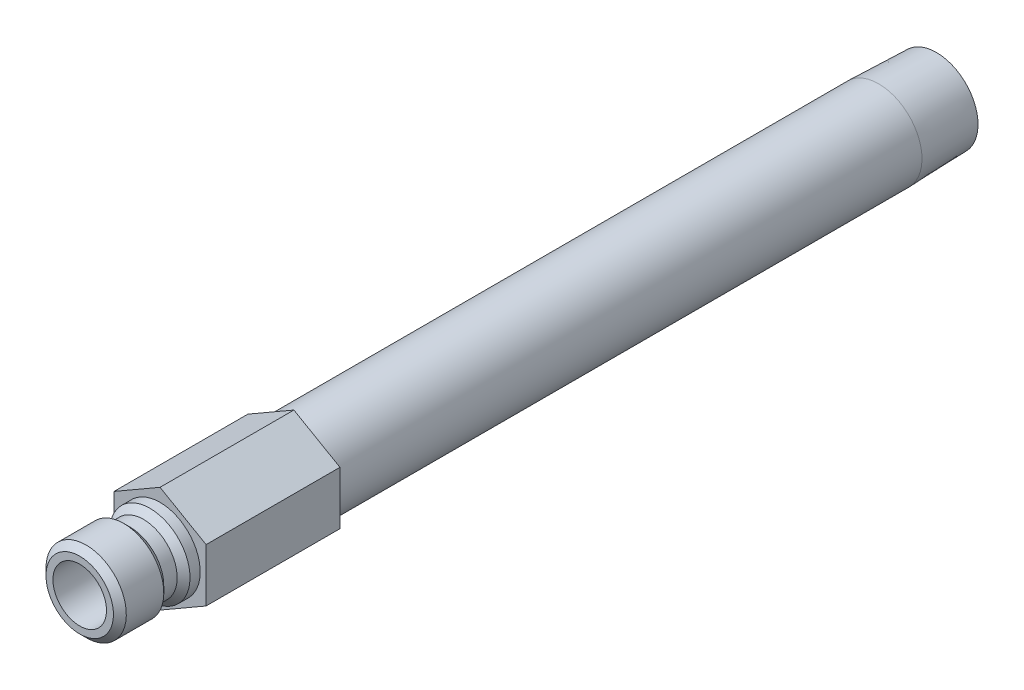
ISO-10303-21;
HEADER;
FILE_DESCRIPTION(('STEP AP214'),'2;1');
FILE_NAME('part.step','',(''),(''),'','','');
FILE_SCHEMA(('AUTOMOTIVE_DESIGN { 1 0 10303 214 1 1 1 1 }'));
ENDSEC;
DATA;
#1=APPLICATION_CONTEXT('core data for automotive mechanical design processes');
#2=APPLICATION_PROTOCOL_DEFINITION('international standard','automotive_design',2000,#1);
#3=PRODUCT_CONTEXT('',#1,'mechanical');
#4=PRODUCT('Part','Part','',(#3));
#5=PRODUCT_RELATED_PRODUCT_CATEGORY('part','',(#4));
#6=PRODUCT_DEFINITION_FORMATION('','',#4);
#7=PRODUCT_DEFINITION_CONTEXT('part definition',#1,'design');
#8=PRODUCT_DEFINITION('design','',#6,#7);
#9=PRODUCT_DEFINITION_SHAPE('','',#8);
#10=(LENGTH_UNIT() NAMED_UNIT(*) SI_UNIT(.MILLI.,.METRE.));
#11=(NAMED_UNIT(*) PLANE_ANGLE_UNIT() SI_UNIT($,.RADIAN.));
#12=(NAMED_UNIT(*) SI_UNIT($,.STERADIAN.) SOLID_ANGLE_UNIT());
#13=UNCERTAINTY_MEASURE_WITH_UNIT(LENGTH_MEASURE(1.E-05),#10,'distance_accuracy_value','');
#14=(GEOMETRIC_REPRESENTATION_CONTEXT(3) GLOBAL_UNCERTAINTY_ASSIGNED_CONTEXT((#13)) GLOBAL_UNIT_ASSIGNED_CONTEXT((#10,
#11,#12)) REPRESENTATION_CONTEXT('',''));
#15=CARTESIAN_POINT('',(0.,0.,0.));
#16=DIRECTION('',(0.,0.,1.));
#17=DIRECTION('',(1.,0.,0.));
#18=AXIS2_PLACEMENT_3D('',#15,#16,#17);
#19=CARTESIAN_POINT('',(0.,4.7625,0.));
#20=DIRECTION('',(0.,0.,1.));
#21=DIRECTION('',(0.,-1.,0.));
#22=AXIS2_PLACEMENT_3D('',#19,#20,#21);
#23=PLANE('',#22);
#24=CARTESIAN_POINT('',(0.,0.,0.));
#25=DIRECTION('',(0.,0.,-1.));
#26=DIRECTION('',(0.,1.,0.));
#27=AXIS2_PLACEMENT_3D('',#24,#25,#26);
#28=CIRCLE('',#27,4.7625);
#29=CARTESIAN_POINT('',(0.,4.7625,0.));
#30=VERTEX_POINT('',#29);
#31=EDGE_CURVE('E166',#30,#30,#28,.T.);
#32=ORIENTED_EDGE('',*,*,#31,.T.);
#33=EDGE_LOOP('',(#32));
#34=FACE_BOUND('',#33,.T.);
#35=DIRECTION('',(-0.866025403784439,-0.5,0.));
#36=VECTOR('',#35,1.);
#37=CARTESIAN_POINT('',(0.,6.3058196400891,0.));
#38=LINE('',#37,#36);
#39=CARTESIAN_POINT('',(0.,6.3058196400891,0.));
#40=VERTEX_POINT('',#39);
#41=CARTESIAN_POINT('',(-5.461,3.15290982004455,0.));
#42=VERTEX_POINT('',#41);
#43=EDGE_CURVE('E122',#40,#42,#38,.T.);
#44=ORIENTED_EDGE('',*,*,#43,.T.);
#45=DIRECTION('',(0.,-1.,0.));
#46=VECTOR('',#45,1.);
#47=CARTESIAN_POINT('',(-5.461,3.15290982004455,0.));
#48=LINE('',#47,#46);
#49=CARTESIAN_POINT('',(-5.461,-3.15290982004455,0.));
#50=VERTEX_POINT('',#49);
#51=EDGE_CURVE('E125',#42,#50,#48,.T.);
#52=ORIENTED_EDGE('',*,*,#51,.T.);
#53=DIRECTION('',(0.866025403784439,-0.5,0.));
#54=VECTOR('',#53,1.);
#55=CARTESIAN_POINT('',(-5.461,-3.15290982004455,0.));
#56=LINE('',#55,#54);
#57=CARTESIAN_POINT('',(0.,-6.30581964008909,0.));
#58=VERTEX_POINT('',#57);
#59=EDGE_CURVE('E129',#50,#58,#56,.T.);
#60=ORIENTED_EDGE('',*,*,#59,.T.);
#61=DIRECTION('',(0.866025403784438,0.5,0.));
#62=VECTOR('',#61,1.);
#63=CARTESIAN_POINT('',(0.,-6.30581964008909,0.));
#64=LINE('',#63,#62);
#65=CARTESIAN_POINT('',(5.461,-3.15290982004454,0.));
#66=VERTEX_POINT('',#65);
#67=EDGE_CURVE('E132',#58,#66,#64,.T.);
#68=ORIENTED_EDGE('',*,*,#67,.T.);
#69=DIRECTION('',(0.,1.,0.));
#70=VECTOR('',#69,1.);
#71=CARTESIAN_POINT('',(5.461,-3.15290982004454,0.));
#72=LINE('',#71,#70);
#73=CARTESIAN_POINT('',(5.461,3.15290982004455,0.));
#74=VERTEX_POINT('',#73);
#75=EDGE_CURVE('E99',#66,#74,#72,.T.);
#76=ORIENTED_EDGE('',*,*,#75,.T.);
#77=DIRECTION('',(-0.866025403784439,0.5,0.));
#78=VECTOR('',#77,1.);
#79=CARTESIAN_POINT('',(5.461,3.15290982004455,0.));
#80=LINE('',#79,#78);
#81=EDGE_CURVE('E135',#74,#40,#80,.T.);
#82=ORIENTED_EDGE('',*,*,#81,.T.);
#83=EDGE_LOOP('',(#44,#52,#60,#68,#76,#82));
#84=FACE_BOUND('',#83,.T.);
#85=ADVANCED_FACE('F33',(#34,#84),#23,.T.);
#86=CARTESIAN_POINT('',(0.,0.,0.));
#87=DIRECTION('',(0.,0.,-1.));
#88=DIRECTION('',(0.,1.,0.));
#89=AXIS2_PLACEMENT_3D('',#86,#87,#88);
#90=CYLINDRICAL_SURFACE('',#89,4.7625);
#91=CARTESIAN_POINT('',(0.,0.,1.2065));
#92=DIRECTION('',(0.,0.,-1.));
#93=DIRECTION('',(0.,1.,0.));
#94=AXIS2_PLACEMENT_3D('',#91,#92,#93);
#95=CIRCLE('',#94,4.7625);
#96=CARTESIAN_POINT('',(0.,4.7625,1.2065));
#97=VERTEX_POINT('',#96);
#98=EDGE_CURVE('E163',#97,#97,#95,.T.);
#99=ORIENTED_EDGE('',*,*,#98,.T.);
#100=EDGE_LOOP('',(#99));
#101=FACE_BOUND('',#100,.T.);
#102=ORIENTED_EDGE('',*,*,#31,.F.);
#103=EDGE_LOOP('',(#102));
#104=FACE_BOUND('',#103,.T.);
#105=ADVANCED_FACE('F192',(#101,#104),#90,.T.);
#106=CARTESIAN_POINT('',(0.,0.,1.2065));
#107=DIRECTION('',(0.,0.,-1.));
#108=DIRECTION('',(0.,1.,0.));
#109=AXIS2_PLACEMENT_3D('',#106,#107,#108);
#110=CONICAL_SURFACE('',#109,4.7625,0.785398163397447);
#111=CARTESIAN_POINT('',(0.,0.,1.9685));
#112=DIRECTION('',(0.,0.,-1.));
#113=DIRECTION('',(0.,1.,0.));
#114=AXIS2_PLACEMENT_3D('',#111,#112,#113);
#115=CIRCLE('',#114,4.0005);
#116=CARTESIAN_POINT('',(0.,4.0005,1.9685));
#117=VERTEX_POINT('',#116);
#118=EDGE_CURVE('E160',#117,#117,#115,.T.);
#119=ORIENTED_EDGE('',*,*,#118,.T.);
#120=EDGE_LOOP('',(#119));
#121=FACE_BOUND('',#120,.T.);
#122=ORIENTED_EDGE('',*,*,#98,.F.);
#123=EDGE_LOOP('',(#122));
#124=FACE_BOUND('',#123,.T.);
#125=ADVANCED_FACE('F198',(#121,#124),#110,.T.);
#126=CARTESIAN_POINT('',(0.,0.,0.));
#127=DIRECTION('',(0.,0.,-1.));
#128=DIRECTION('',(0.,1.,0.));
#129=AXIS2_PLACEMENT_3D('',#126,#127,#128);
#130=CYLINDRICAL_SURFACE('',#129,4.0005);
#131=CARTESIAN_POINT('',(0.,0.,3.556));
#132=DIRECTION('',(0.,0.,-1.));
#133=DIRECTION('',(0.,1.,0.));
#134=AXIS2_PLACEMENT_3D('',#131,#132,#133);
#135=CIRCLE('',#134,4.0005);
#136=CARTESIAN_POINT('',(0.,4.0005,3.556));
#137=VERTEX_POINT('',#136);
#138=EDGE_CURVE('E157',#137,#137,#135,.T.);
#139=ORIENTED_EDGE('',*,*,#138,.T.);
#140=EDGE_LOOP('',(#139));
#141=FACE_BOUND('',#140,.T.);
#142=ORIENTED_EDGE('',*,*,#118,.F.);
#143=EDGE_LOOP('',(#142));
#144=FACE_BOUND('',#143,.T.);
#145=ADVANCED_FACE('F258',(#141,#144),#130,.T.);
#146=CARTESIAN_POINT('',(0.,0.,3.556));
#147=DIRECTION('',(0.,0.,1.));
#148=DIRECTION('',(0.,-1.,0.));
#149=AXIS2_PLACEMENT_3D('',#146,#147,#148);
#150=CONICAL_SURFACE('',#149,4.0005,0.785398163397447);
#151=CARTESIAN_POINT('',(0.,0.,4.318));
#152=DIRECTION('',(0.,0.,-1.));
#153=DIRECTION('',(0.,1.,0.));
#154=AXIS2_PLACEMENT_3D('',#151,#152,#153);
#155=CIRCLE('',#154,4.7625);
#156=CARTESIAN_POINT('',(0.,4.7625,4.318));
#157=VERTEX_POINT('',#156);
#158=EDGE_CURVE('E154',#157,#157,#155,.T.);
#159=ORIENTED_EDGE('',*,*,#158,.T.);
#160=EDGE_LOOP('',(#159));
#161=FACE_BOUND('',#160,.T.);
#162=ORIENTED_EDGE('',*,*,#138,.F.);
#163=EDGE_LOOP('',(#162));
#164=FACE_BOUND('',#163,.T.);
#165=ADVANCED_FACE('F254',(#161,#164),#150,.T.);
#166=CARTESIAN_POINT('',(0.,0.,0.));
#167=DIRECTION('',(0.,0.,-1.));
#168=DIRECTION('',(0.,1.,0.));
#169=AXIS2_PLACEMENT_3D('',#166,#167,#168);
#170=CYLINDRICAL_SURFACE('',#169,4.7625);
#171=CARTESIAN_POINT('',(0.,0.,8.763));
#172=DIRECTION('',(0.,0.,-1.));
#173=DIRECTION('',(0.,1.,0.));
#174=AXIS2_PLACEMENT_3D('',#171,#172,#173);
#175=CIRCLE('',#174,4.7625);
#176=CARTESIAN_POINT('',(0.,4.7625,8.763));
#177=VERTEX_POINT('',#176);
#178=EDGE_CURVE('E151',#177,#177,#175,.T.);
#179=ORIENTED_EDGE('',*,*,#178,.T.);
#180=EDGE_LOOP('',(#179));
#181=FACE_BOUND('',#180,.T.);
#182=ORIENTED_EDGE('',*,*,#158,.F.);
#183=EDGE_LOOP('',(#182));
#184=FACE_BOUND('',#183,.T.);
#185=ADVANCED_FACE('F250',(#181,#184),#170,.T.);
#186=CARTESIAN_POINT('',(0.,0.,8.763));
#187=DIRECTION('',(0.,0.,-1.));
#188=DIRECTION('',(0.,1.,0.));
#189=AXIS2_PLACEMENT_3D('',#186,#187,#188);
#190=CONICAL_SURFACE('',#189,4.7625,0.785398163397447);
#191=CARTESIAN_POINT('',(0.,0.,9.525));
#192=DIRECTION('',(0.,0.,-1.));
#193=DIRECTION('',(0.,1.,0.));
#194=AXIS2_PLACEMENT_3D('',#191,#192,#193);
#195=CIRCLE('',#194,4.0005);
#196=CARTESIAN_POINT('',(0.,4.0005,9.525));
#197=VERTEX_POINT('',#196);
#198=EDGE_CURVE('E148',#197,#197,#195,.T.);
#199=ORIENTED_EDGE('',*,*,#198,.T.);
#200=EDGE_LOOP('',(#199));
#201=FACE_BOUND('',#200,.T.);
#202=ORIENTED_EDGE('',*,*,#178,.F.);
#203=EDGE_LOOP('',(#202));
#204=FACE_BOUND('',#203,.T.);
#205=ADVANCED_FACE('F246',(#201,#204),#190,.T.);
#206=CARTESIAN_POINT('',(0.,3.175,9.525));
#207=DIRECTION('',(0.,0.,1.));
#208=DIRECTION('',(0.,-1.,0.));
#209=AXIS2_PLACEMENT_3D('',#206,#207,#208);
#210=PLANE('',#209);
#211=CARTESIAN_POINT('',(0.,0.,9.525));
#212=DIRECTION('',(0.,0.,-1.));
#213=DIRECTION('',(0.,1.,0.));
#214=AXIS2_PLACEMENT_3D('',#211,#212,#213);
#215=CIRCLE('',#214,3.175);
#216=CARTESIAN_POINT('',(0.,3.175,9.525));
#217=VERTEX_POINT('',#216);
#218=EDGE_CURVE('E145',#217,#217,#215,.T.);
#219=ORIENTED_EDGE('',*,*,#218,.T.);
#220=EDGE_LOOP('',(#219));
#221=FACE_BOUND('',#220,.T.);
#222=ORIENTED_EDGE('',*,*,#198,.F.);
#223=EDGE_LOOP('',(#222));
#224=FACE_BOUND('',#223,.T.);
#225=ADVANCED_FACE('F242',(#221,#224),#210,.T.);
#226=CARTESIAN_POINT('',(0.,0.,0.));
#227=DIRECTION('',(0.,0.,-1.));
#228=DIRECTION('',(0.,1.,0.));
#229=AXIS2_PLACEMENT_3D('',#226,#227,#228);
#230=CYLINDRICAL_SURFACE('',#229,3.175);
#231=CARTESIAN_POINT('',(0.,0.,0.));
#232=DIRECTION('',(0.,0.,1.));
#233=DIRECTION('',(1.,0.,0.));
#234=AXIS2_PLACEMENT_3D('',#231,#232,#233);
#235=CIRCLE('',#234,3.175);
#236=CARTESIAN_POINT('',(3.175,0.,0.));
#237=VERTEX_POINT('',#236);
#238=EDGE_CURVE('E11',#237,#237,#235,.T.);
#239=ORIENTED_EDGE('',*,*,#238,.F.);
#240=EDGE_LOOP('',(#239));
#241=FACE_BOUND('',#240,.T.);
#242=ORIENTED_EDGE('',*,*,#218,.F.);
#243=EDGE_LOOP('',(#242));
#244=FACE_BOUND('',#243,.T.);
#245=ADVANCED_FACE('F226',(#241,#244),#230,.F.);
#246=CARTESIAN_POINT('',(-5.461,3.15290982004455,0.));
#247=DIRECTION('',(0.,0.,1.));
#248=DIRECTION('',(1.,0.,0.));
#249=AXIS2_PLACEMENT_3D('',#246,#247,#248);
#250=PLANE('',#249);
#251=ORIENTED_EDGE('',*,*,#238,.T.);
#252=EDGE_LOOP('',(#251));
#253=FACE_BOUND('',#252,.T.);
#254=CARTESIAN_POINT('',(0.,0.,0.));
#255=DIRECTION('',(0.,0.,1.));
#256=DIRECTION('',(1.,0.,0.));
#257=AXIS2_PLACEMENT_3D('',#254,#255,#256);
#258=CIRCLE('',#257,2.38124999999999);
#259=CARTESIAN_POINT('',(2.38124999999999,0.,0.));
#260=VERTEX_POINT('',#259);
#261=EDGE_CURVE('E126',#260,#260,#258,.T.);
#262=ORIENTED_EDGE('',*,*,#261,.F.);
#263=EDGE_LOOP('',(#262));
#264=FACE_BOUND('',#263,.T.);
#265=ADVANCED_FACE('F222',(#253,#264),#250,.T.);
#266=CARTESIAN_POINT('',(0.,6.3058196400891,-15.875));
#267=DIRECTION('',(-0.5,0.866025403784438,0.));
#268=DIRECTION('',(-0.866025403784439,-0.5,0.));
#269=AXIS2_PLACEMENT_3D('',#266,#267,#268);
#270=PLANE('',#269);
#271=ORIENTED_EDGE('',*,*,#43,.F.);
#272=DIRECTION('',(0.,0.,1.));
#273=VECTOR('',#272,1.);
#274=CARTESIAN_POINT('',(0.,6.3058196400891,-15.875));
#275=LINE('',#274,#273);
#276=CARTESIAN_POINT('',(0.,6.3058196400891,-15.875));
#277=VERTEX_POINT('',#276);
#278=EDGE_CURVE('E51',#277,#40,#275,.T.);
#279=ORIENTED_EDGE('',*,*,#278,.F.);
#280=DIRECTION('',(-0.866025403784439,-0.5,0.));
#281=VECTOR('',#280,1.);
#282=CARTESIAN_POINT('',(0.,6.3058196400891,-15.875));
#283=LINE('',#282,#281);
#284=CARTESIAN_POINT('',(-5.461,3.15290982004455,-15.875));
#285=VERTEX_POINT('',#284);
#286=EDGE_CURVE('E138',#277,#285,#283,.T.);
#287=ORIENTED_EDGE('',*,*,#286,.T.);
#288=DIRECTION('',(0.,0.,1.));
#289=VECTOR('',#288,1.);
#290=CARTESIAN_POINT('',(-5.461,3.15290982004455,-15.875));
#291=LINE('',#290,#289);
#292=EDGE_CURVE('E86',#285,#42,#291,.T.);
#293=ORIENTED_EDGE('',*,*,#292,.T.);
#294=EDGE_LOOP('',(#271,#279,#287,#293));
#295=FACE_BOUND('',#294,.T.);
#296=ADVANCED_FACE('F225',(#295),#270,.T.);
#297=CARTESIAN_POINT('',(5.461,3.15290982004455,-15.875));
#298=DIRECTION('',(0.5,0.866025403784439,0.));
#299=DIRECTION('',(-0.866025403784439,0.5,0.));
#300=AXIS2_PLACEMENT_3D('',#297,#298,#299);
#301=PLANE('',#300);
#302=ORIENTED_EDGE('',*,*,#81,.F.);
#303=DIRECTION('',(0.,0.,1.));
#304=VECTOR('',#303,1.);
#305=CARTESIAN_POINT('',(5.461,3.15290982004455,-15.875));
#306=LINE('',#305,#304);
#307=CARTESIAN_POINT('',(5.461,3.15290982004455,-15.875));
#308=VERTEX_POINT('',#307);
#309=EDGE_CURVE('E74',#308,#74,#306,.T.);
#310=ORIENTED_EDGE('',*,*,#309,.F.);
#311=DIRECTION('',(-0.866025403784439,0.5,0.));
#312=VECTOR('',#311,1.);
#313=CARTESIAN_POINT('',(5.461,3.15290982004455,-15.875));
#314=LINE('',#313,#312);
#315=EDGE_CURVE('E112',#308,#277,#314,.T.);
#316=ORIENTED_EDGE('',*,*,#315,.T.);
#317=ORIENTED_EDGE('',*,*,#278,.T.);
#318=EDGE_LOOP('',(#302,#310,#316,#317));
#319=FACE_BOUND('',#318,.T.);
#320=ADVANCED_FACE('F228',(#319),#301,.T.);
#321=CARTESIAN_POINT('',(5.461,-3.15290982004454,-15.875));
#322=DIRECTION('',(1.,0.,0.));
#323=DIRECTION('',(0.,1.,0.));
#324=AXIS2_PLACEMENT_3D('',#321,#322,#323);
#325=PLANE('',#324);
#326=ORIENTED_EDGE('',*,*,#75,.F.);
#327=DIRECTION('',(0.,0.,1.));
#328=VECTOR('',#327,1.);
#329=CARTESIAN_POINT('',(5.461,-3.15290982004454,-15.875));
#330=LINE('',#329,#328);
#331=CARTESIAN_POINT('',(5.461,-3.15290982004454,-15.875));
#332=VERTEX_POINT('',#331);
#333=EDGE_CURVE('E94',#332,#66,#330,.T.);
#334=ORIENTED_EDGE('',*,*,#333,.F.);
#335=DIRECTION('',(0.,1.,0.));
#336=VECTOR('',#335,1.);
#337=CARTESIAN_POINT('',(5.461,-3.15290982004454,-15.875));
#338=LINE('',#337,#336);
#339=EDGE_CURVE('E97',#332,#308,#338,.T.);
#340=ORIENTED_EDGE('',*,*,#339,.T.);
#341=ORIENTED_EDGE('',*,*,#309,.T.);
#342=EDGE_LOOP('',(#326,#334,#340,#341));
#343=FACE_BOUND('',#342,.T.);
#344=ADVANCED_FACE('F96',(#343),#325,.T.);
#345=CARTESIAN_POINT('',(0.,-6.30581964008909,-15.875));
#346=DIRECTION('',(0.5,-0.866025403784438,0.));
#347=DIRECTION('',(0.866025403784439,0.5,0.));
#348=AXIS2_PLACEMENT_3D('',#345,#346,#347);
#349=PLANE('',#348);
#350=ORIENTED_EDGE('',*,*,#67,.F.);
#351=DIRECTION('',(0.,0.,1.));
#352=VECTOR('',#351,1.);
#353=CARTESIAN_POINT('',(0.,-6.30581964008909,-15.875));
#354=LINE('',#353,#352);
#355=CARTESIAN_POINT('',(0.,-6.30581964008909,-15.875));
#356=VERTEX_POINT('',#355);
#357=EDGE_CURVE('E104',#356,#58,#354,.T.);
#358=ORIENTED_EDGE('',*,*,#357,.F.);
#359=DIRECTION('',(0.866025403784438,0.5,0.));
#360=VECTOR('',#359,1.);
#361=CARTESIAN_POINT('',(0.,-6.30581964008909,-15.875));
#362=LINE('',#361,#360);
#363=EDGE_CURVE('E110',#356,#332,#362,.T.);
#364=ORIENTED_EDGE('',*,*,#363,.T.);
#365=ORIENTED_EDGE('',*,*,#333,.T.);
#366=EDGE_LOOP('',(#350,#358,#364,#365));
#367=FACE_BOUND('',#366,.T.);
#368=ADVANCED_FACE('F114',(#367),#349,.T.);
#369=CARTESIAN_POINT('',(-5.461,-3.15290982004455,-15.875));
#370=DIRECTION('',(-0.5,-0.866025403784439,0.));
#371=DIRECTION('',(0.866025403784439,-0.5,0.));
#372=AXIS2_PLACEMENT_3D('',#369,#370,#371);
#373=PLANE('',#372);
#374=ORIENTED_EDGE('',*,*,#59,.F.);
#375=DIRECTION('',(0.,0.,1.));
#376=VECTOR('',#375,1.);
#377=CARTESIAN_POINT('',(-5.461,-3.15290982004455,-15.875));
#378=LINE('',#377,#376);
#379=CARTESIAN_POINT('',(-5.461,-3.15290982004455,-15.875));
#380=VERTEX_POINT('',#379);
#381=EDGE_CURVE('E142',#380,#50,#378,.T.);
#382=ORIENTED_EDGE('',*,*,#381,.F.);
#383=DIRECTION('',(0.866025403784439,-0.5,0.));
#384=VECTOR('',#383,1.);
#385=CARTESIAN_POINT('',(-5.461,-3.15290982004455,-15.875));
#386=LINE('',#385,#384);
#387=EDGE_CURVE('E115',#380,#356,#386,.T.);
#388=ORIENTED_EDGE('',*,*,#387,.T.);
#389=ORIENTED_EDGE('',*,*,#357,.T.);
#390=EDGE_LOOP('',(#374,#382,#388,#389));
#391=FACE_BOUND('',#390,.T.);
#392=ADVANCED_FACE('F219',(#391),#373,.T.);
#393=CARTESIAN_POINT('',(-5.461,3.15290982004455,-15.875));
#394=DIRECTION('',(-1.,0.,0.));
#395=DIRECTION('',(0.,0.,1.));
#396=AXIS2_PLACEMENT_3D('',#393,#394,#395);
#397=PLANE('',#396);
#398=ORIENTED_EDGE('',*,*,#51,.F.);
#399=ORIENTED_EDGE('',*,*,#292,.F.);
#400=DIRECTION('',(0.,-1.,0.));
#401=VECTOR('',#400,1.);
#402=CARTESIAN_POINT('',(-5.461,3.15290982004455,-15.875));
#403=LINE('',#402,#401);
#404=EDGE_CURVE('E117',#285,#380,#403,.T.);
#405=ORIENTED_EDGE('',*,*,#404,.T.);
#406=ORIENTED_EDGE('',*,*,#381,.T.);
#407=EDGE_LOOP('',(#398,#399,#405,#406));
#408=FACE_BOUND('',#407,.T.);
#409=ADVANCED_FACE('F214',(#408),#397,.T.);
#410=CARTESIAN_POINT('',(-5.461,3.15290982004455,-15.875));
#411=DIRECTION('',(0.,0.,1.));
#412=DIRECTION('',(1.,0.,0.));
#413=AXIS2_PLACEMENT_3D('',#410,#411,#412);
#414=PLANE('',#413);
#415=CARTESIAN_POINT('',(0.,0.,-15.875));
#416=DIRECTION('',(0.,0.,1.));
#417=DIRECTION('',(1.,0.,0.));
#418=AXIS2_PLACEMENT_3D('',#415,#416,#417);
#419=CIRCLE('',#418,5.1435);
#420=CARTESIAN_POINT('',(5.1435,0.,-15.875));
#421=VERTEX_POINT('',#420);
#422=EDGE_CURVE('E37',#421,#421,#419,.F.);
#423=ORIENTED_EDGE('',*,*,#422,.F.);
#424=EDGE_LOOP('',(#423));
#425=FACE_BOUND('',#424,.T.);
#426=ORIENTED_EDGE('',*,*,#286,.F.);
#427=ORIENTED_EDGE('',*,*,#315,.F.);
#428=ORIENTED_EDGE('',*,*,#339,.F.);
#429=ORIENTED_EDGE('',*,*,#363,.F.);
#430=ORIENTED_EDGE('',*,*,#387,.F.);
#431=ORIENTED_EDGE('',*,*,#404,.F.);
#432=EDGE_LOOP('',(#426,#427,#428,#429,#430,#431));
#433=FACE_BOUND('',#432,.T.);
#434=ADVANCED_FACE('F108',(#425,#433),#414,.F.);
#435=CARTESIAN_POINT('',(0.,0.,0.));
#436=DIRECTION('',(0.,0.,-1.));
#437=DIRECTION('',(0.,1.,0.));
#438=AXIS2_PLACEMENT_3D('',#435,#436,#437);
#439=CYLINDRICAL_SURFACE('',#438,2.38124999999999);
#440=CARTESIAN_POINT('',(0.,0.,-92.075));
#441=DIRECTION('',(0.,0.,-1.));
#442=DIRECTION('',(0.,1.,0.));
#443=AXIS2_PLACEMENT_3D('',#440,#441,#442);
#444=CIRCLE('',#443,2.38124999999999);
#445=CARTESIAN_POINT('',(0.,2.38125,-92.075));
#446=VERTEX_POINT('',#445);
#447=EDGE_CURVE('E43',#446,#446,#444,.T.);
#448=ORIENTED_EDGE('',*,*,#447,.T.);
#449=EDGE_LOOP('',(#448));
#450=FACE_BOUND('',#449,.T.);
#451=ORIENTED_EDGE('',*,*,#261,.T.);
#452=EDGE_LOOP('',(#451));
#453=FACE_BOUND('',#452,.T.);
#454=ADVANCED_FACE('F35',(#450,#453),#439,.F.);
#455=CARTESIAN_POINT('',(0.,4.9291887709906,-92.075));
#456=DIRECTION('',(0.,0.,-1.));
#457=DIRECTION('',(0.,1.,0.));
#458=AXIS2_PLACEMENT_3D('',#455,#456,#457);
#459=PLANE('',#458);
#460=CARTESIAN_POINT('',(0.,0.,-92.075));
#461=DIRECTION('',(0.,0.,-1.));
#462=DIRECTION('',(0.,1.,0.));
#463=AXIS2_PLACEMENT_3D('',#460,#461,#462);
#464=CIRCLE('',#463,4.92918877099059);
#465=CARTESIAN_POINT('',(0.,4.9291887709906,-92.075));
#466=VERTEX_POINT('',#465);
#467=EDGE_CURVE('E172',#466,#466,#464,.T.);
#468=ORIENTED_EDGE('',*,*,#467,.T.);
#469=EDGE_LOOP('',(#468));
#470=FACE_BOUND('',#469,.T.);
#471=ORIENTED_EDGE('',*,*,#447,.F.);
#472=EDGE_LOOP('',(#471));
#473=FACE_BOUND('',#472,.T.);
#474=ADVANCED_FACE('F180',(#470,#473),#459,.T.);
#475=CARTESIAN_POINT('',(0.,0.,-92.075));
#476=DIRECTION('',(0.,0.,1.));
#477=DIRECTION('',(0.,-1.,0.));
#478=AXIS2_PLACEMENT_3D('',#475,#476,#477);
#479=CONICAL_SURFACE('',#478,4.92918877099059,0.0312396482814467);
#480=CARTESIAN_POINT('',(0.,0.,-85.217));
#481=DIRECTION('',(0.,0.,-1.));
#482=DIRECTION('',(0.,1.,0.));
#483=AXIS2_PLACEMENT_3D('',#480,#481,#482);
#484=CIRCLE('',#483,5.14349999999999);
#485=CARTESIAN_POINT('',(0.,5.1435,-85.217));
#486=VERTEX_POINT('',#485);
#487=EDGE_CURVE('E169',#486,#486,#484,.T.);
#488=ORIENTED_EDGE('',*,*,#487,.T.);
#489=EDGE_LOOP('',(#488));
#490=FACE_BOUND('',#489,.T.);
#491=ORIENTED_EDGE('',*,*,#467,.F.);
#492=EDGE_LOOP('',(#491));
#493=FACE_BOUND('',#492,.T.);
#494=ADVANCED_FACE('F182',(#490,#493),#479,.T.);
#495=CARTESIAN_POINT('',(0.,0.,0.));
#496=DIRECTION('',(0.,0.,-1.));
#497=DIRECTION('',(0.,1.,0.));
#498=AXIS2_PLACEMENT_3D('',#495,#496,#497);
#499=CYLINDRICAL_SURFACE('',#498,5.1435);
#500=ORIENTED_EDGE('',*,*,#487,.F.);
#501=EDGE_LOOP('',(#500));
#502=FACE_BOUND('',#501,.T.);
#503=ORIENTED_EDGE('',*,*,#422,.T.);
#504=EDGE_LOOP('',(#503));
#505=FACE_BOUND('',#504,.T.);
#506=ADVANCED_FACE('F188',(#502,#505),#499,.T.);
#507=CLOSED_SHELL('',(#85,#105,#125,#145,#165,#185,#205,#225,#245,#265,#296,#320,#344,#368,#392,
#409,#434,#454,#474,#494,#506));
#508=MANIFOLD_SOLID_BREP('B2',#507);
#509=ADVANCED_BREP_SHAPE_REPRESENTATION('',(#18,#508),#14);
#510=SHAPE_DEFINITION_REPRESENTATION(#9,#509);
ENDSEC;
END-ISO-10303-21;
